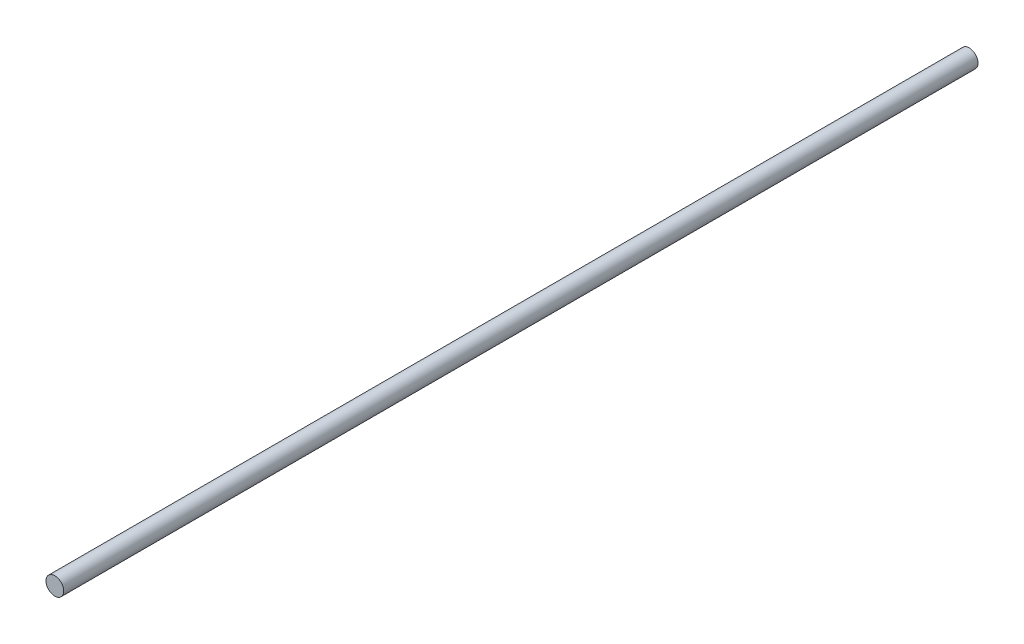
from build123d import *

# Parameters (mm, degrees)
SKETCH1_R           = 30
BOSS_EXTRUDE1_DEPTH = 3100


with BuildPart() as part:
    # Sketch1 → Boss-Extrude1 (new body)
    with BuildSketch(Plane.XY):
        Circle(SKETCH1_R)
    extrude(amount=-BOSS_EXTRUDE1_DEPTH)


solid = part.part
